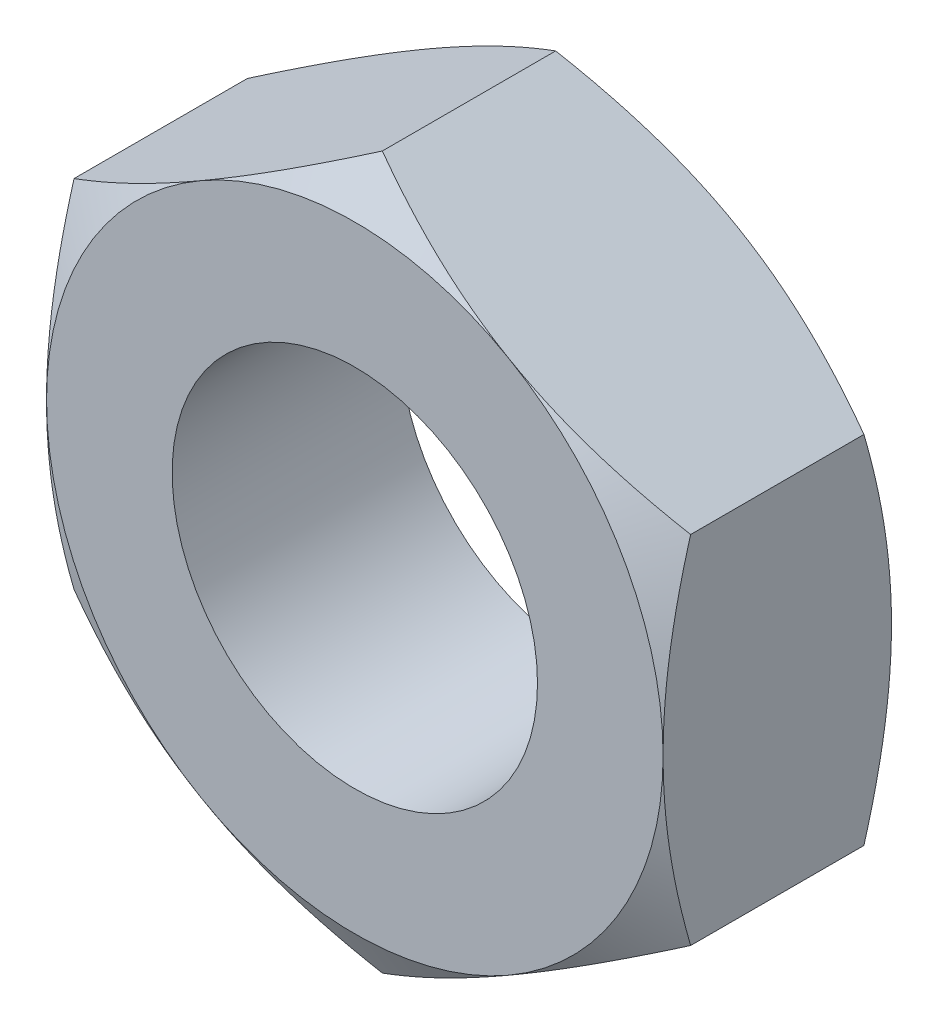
ISO-10303-21;
HEADER;
FILE_DESCRIPTION(('STEP AP214'),'2;1');
FILE_NAME('part.step','',(''),(''),'','','');
FILE_SCHEMA(('AUTOMOTIVE_DESIGN { 1 0 10303 214 1 1 1 1 }'));
ENDSEC;
DATA;
#1=APPLICATION_CONTEXT('core data for automotive mechanical design processes');
#2=APPLICATION_PROTOCOL_DEFINITION('international standard','automotive_design',2000,#1);
#3=PRODUCT_CONTEXT('',#1,'mechanical');
#4=PRODUCT('Part','Part','',(#3));
#5=PRODUCT_RELATED_PRODUCT_CATEGORY('part','',(#4));
#6=PRODUCT_DEFINITION_FORMATION('','',#4);
#7=PRODUCT_DEFINITION_CONTEXT('part definition',#1,'design');
#8=PRODUCT_DEFINITION('design','',#6,#7);
#9=PRODUCT_DEFINITION_SHAPE('','',#8);
#10=(LENGTH_UNIT() NAMED_UNIT(*) SI_UNIT(.MILLI.,.METRE.));
#11=(NAMED_UNIT(*) PLANE_ANGLE_UNIT() SI_UNIT($,.RADIAN.));
#12=(NAMED_UNIT(*) SI_UNIT($,.STERADIAN.) SOLID_ANGLE_UNIT());
#13=UNCERTAINTY_MEASURE_WITH_UNIT(LENGTH_MEASURE(1.E-05),#10,'distance_accuracy_value','');
#14=(GEOMETRIC_REPRESENTATION_CONTEXT(3) GLOBAL_UNCERTAINTY_ASSIGNED_CONTEXT((#13)) GLOBAL_UNIT_ASSIGNED_CONTEXT((#10,
#11,#12)) REPRESENTATION_CONTEXT('',''));
#15=CARTESIAN_POINT('',(0.,0.,0.));
#16=DIRECTION('',(0.,0.,1.));
#17=DIRECTION('',(1.,0.,0.));
#18=AXIS2_PLACEMENT_3D('',#15,#16,#17);
#19=CARTESIAN_POINT('',(13.5,7.79422863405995,10.));
#20=DIRECTION('',(-0.5,-0.866025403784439,0.));
#21=DIRECTION('',(0.866025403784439,-0.5,0.));
#22=AXIS2_PLACEMENT_3D('',#19,#20,#21);
#23=PLANE('',#22);
#24=CARTESIAN_POINT('',(-0.000199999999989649,15.5885727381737,1.20583803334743));
#25=CARTESIAN_POINT('',(0.296524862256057,15.417258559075,1.10693600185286));
#26=CARTESIAN_POINT('',(0.594407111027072,15.2452761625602,1.01252193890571));
#27=CARTESIAN_POINT('',(1.19256027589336,14.899932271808,0.833917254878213));
#28=CARTESIAN_POINT('',(1.49283194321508,14.7265703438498,0.749729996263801));
#29=CARTESIAN_POINT('',(2.09634426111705,14.3781323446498,0.592710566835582));
#30=CARTESIAN_POINT('',(2.39959019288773,14.2030532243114,0.519905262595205));
#31=CARTESIAN_POINT('',(3.00818925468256,13.8516783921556,0.387213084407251));
#32=CARTESIAN_POINT('',(3.31354226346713,13.6753827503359,0.327325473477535));
#33=CARTESIAN_POINT('',(3.91853115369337,13.3260922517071,0.223015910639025));
#34=CARTESIAN_POINT('',(4.21812211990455,13.1531233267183,0.178248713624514));
#35=CARTESIAN_POINT('',(4.81867684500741,12.8063928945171,0.103183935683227));
#36=CARTESIAN_POINT('',(5.11964063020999,12.632631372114,0.0728866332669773));
#37=CARTESIAN_POINT('',(5.72207378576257,12.284816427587,0.0275266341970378));
#38=CARTESIAN_POINT('',(6.02354212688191,12.1107635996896,0.0124458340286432));
#39=CARTESIAN_POINT('',(6.62675710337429,11.7624972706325,-0.00215683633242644));
#40=CARTESIAN_POINT('',(6.92850372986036,11.5882837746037,-0.00167918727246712));
#41=CARTESIAN_POINT('',(7.49261810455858,11.2625921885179,0.0137483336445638));
#42=CARTESIAN_POINT('',(7.75502605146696,11.1110908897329,0.0268164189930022));
#43=CARTESIAN_POINT('',(8.2792383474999,10.8084367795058,0.0644725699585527));
#44=CARTESIAN_POINT('',(8.54104265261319,10.6572839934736,0.0890614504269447));
#45=CARTESIAN_POINT('',(9.06390546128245,10.3554090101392,0.149330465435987));
#46=CARTESIAN_POINT('',(9.3249631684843,10.2046872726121,0.1850197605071));
#47=CARTESIAN_POINT('',(9.84585469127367,9.90395041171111,0.266863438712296));
#48=CARTESIAN_POINT('',(10.1056884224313,9.75393533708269,0.313018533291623));
#49=CARTESIAN_POINT('',(10.8944281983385,9.29855621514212,0.46834925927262));
#50=CARTESIAN_POINT('',(11.4210501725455,8.99451087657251,0.593013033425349));
#51=CARTESIAN_POINT('',(12.4664415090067,8.39095390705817,0.875948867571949));
#52=CARTESIAN_POINT('',(12.9852242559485,8.09143454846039,1.03415447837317));
#53=CARTESIAN_POINT('',(13.5002,7.79411316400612,1.20583803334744));
#54=B_SPLINE_CURVE_WITH_KNOTS('',3,(#24,#25,#26,#27,#28,#29,#30,#31,#32,#33,#34,#35,#36,#37,#38,
#39,#40,#41,#42,#43,#44,#45,#46,#47,#48,#49,#50,#51,#52,#53),.UNSPECIFIED.,.F.,.F.,(4,2,2,2,2,2,
2,2,2,2,2,2,2,2,4),(0.,1.06987949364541,2.14010980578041,3.21282939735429,4.28548777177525,
5.33167033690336,6.37787303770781,7.42282956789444,8.46775380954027,9.377387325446,
10.2870851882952,11.1975357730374,12.1080482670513,13.9691139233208,15.8265265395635),.UNSPECIFIED.);
#55=CARTESIAN_POINT('',(0.,15.5884572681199,1.20577136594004));
#56=VERTEX_POINT('',#55);
#57=CARTESIAN_POINT('',(6.75,11.6913429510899,0.));
#58=VERTEX_POINT('',#57);
#59=EDGE_CURVE('E29',#56,#58,#54,.T.);
#60=ORIENTED_EDGE('',*,*,#59,.F.);
#61=DIRECTION('',(0.,0.,-1.));
#62=VECTOR('',#61,1.);
#63=CARTESIAN_POINT('',(0.,15.5884572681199,10.));
#64=LINE('',#63,#62);
#65=CARTESIAN_POINT('',(0.,15.5884572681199,8.79422863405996));
#66=VERTEX_POINT('',#65);
#67=EDGE_CURVE('E146',#66,#56,#64,.T.);
#68=ORIENTED_EDGE('',*,*,#67,.F.);
#69=CARTESIAN_POINT('',(13.5002,7.79411316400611,8.79416196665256));
#70=CARTESIAN_POINT('',(13.2034751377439,7.9654273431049,8.89306399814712));
#71=CARTESIAN_POINT('',(12.9055928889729,8.13740973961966,8.98747806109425));
#72=CARTESIAN_POINT('',(12.3074397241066,8.48275363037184,9.16608274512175));
#73=CARTESIAN_POINT('',(12.0071680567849,8.65611555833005,9.25027000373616));
#74=CARTESIAN_POINT('',(11.403655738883,9.00455355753,9.40728943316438));
#75=CARTESIAN_POINT('',(11.1004098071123,9.17963267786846,9.48009473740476));
#76=CARTESIAN_POINT('',(10.4918107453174,9.53100751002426,9.61278691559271));
#77=CARTESIAN_POINT('',(10.1864577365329,9.7073031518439,9.67267452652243));
#78=CARTESIAN_POINT('',(9.58146884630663,10.0565936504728,9.77698408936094));
#79=CARTESIAN_POINT('',(9.28187788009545,10.2295625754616,9.82175128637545));
#80=CARTESIAN_POINT('',(8.68132315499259,10.5762930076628,9.89681606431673));
#81=CARTESIAN_POINT('',(8.38035936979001,10.7500545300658,9.92711336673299));
#82=CARTESIAN_POINT('',(7.77792621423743,11.0978694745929,9.97247336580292));
#83=CARTESIAN_POINT('',(7.47645787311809,11.2719223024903,9.98755416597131));
#84=CARTESIAN_POINT('',(6.87324289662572,11.6201886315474,10.0021568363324));
#85=CARTESIAN_POINT('',(6.57149627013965,11.7944021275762,10.0016791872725));
#86=CARTESIAN_POINT('',(6.00738189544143,12.1200937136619,9.98625166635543));
#87=CARTESIAN_POINT('',(5.74497394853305,12.271595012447,9.97318358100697));
#88=CARTESIAN_POINT('',(5.22076165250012,12.5742491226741,9.9355274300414));
#89=CARTESIAN_POINT('',(4.95895734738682,12.7254019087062,9.91093854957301));
#90=CARTESIAN_POINT('',(4.43609453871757,13.0272768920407,9.85066953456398));
#91=CARTESIAN_POINT('',(4.17503683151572,13.1779986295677,9.81498023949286));
#92=CARTESIAN_POINT('',(3.65414530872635,13.4787354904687,9.73313656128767));
#93=CARTESIAN_POINT('',(3.39431157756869,13.6287505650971,9.68698146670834));
#94=CARTESIAN_POINT('',(2.60557180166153,14.0841296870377,9.53165074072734));
#95=CARTESIAN_POINT('',(2.07894982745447,14.3881750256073,9.40698696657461));
#96=CARTESIAN_POINT('',(1.03355849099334,14.9917319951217,9.12405113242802));
#97=CARTESIAN_POINT('',(0.514775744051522,15.2912513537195,8.96584552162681));
#98=CARTESIAN_POINT('',(-0.000199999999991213,15.5885727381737,8.79416196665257));
#99=B_SPLINE_CURVE_WITH_KNOTS('',3,(#69,#70,#71,#72,#73,#74,#75,#76,#77,#78,#79,#80,#81,#82,#83,
#84,#85,#86,#87,#88,#89,#90,#91,#92,#93,#94,#95,#96,#97,#98),.UNSPECIFIED.,.F.,.F.,(4,2,2,2,2,2,
2,2,2,2,2,2,2,2,4),(0.,1.0698794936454,2.14010980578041,3.21282939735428,4.28548777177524,
5.33167033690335,6.3778730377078,7.42282956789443,8.46775380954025,9.37738732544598,
10.2870851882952,11.1975357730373,12.1080482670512,13.9691139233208,15.8265265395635),.UNSPECIFIED.);
#100=CARTESIAN_POINT('',(6.75,11.6913429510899,10.));
#101=VERTEX_POINT('',#100);
#102=EDGE_CURVE('E205',#101,#66,#99,.T.);
#103=ORIENTED_EDGE('',*,*,#102,.F.);
#104=CARTESIAN_POINT('',(13.5,7.79422863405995,8.79422863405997));
#105=VERTEX_POINT('',#104);
#106=EDGE_CURVE('E313',#105,#101,#99,.T.);
#107=ORIENTED_EDGE('',*,*,#106,.F.);
#108=DIRECTION('',(0.,0.,-1.));
#109=VECTOR('',#108,1.);
#110=CARTESIAN_POINT('',(13.5,7.79422863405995,10.));
#111=LINE('',#110,#109);
#112=CARTESIAN_POINT('',(13.5,7.79422863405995,1.20577136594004));
#113=VERTEX_POINT('',#112);
#114=EDGE_CURVE('E132',#105,#113,#111,.T.);
#115=ORIENTED_EDGE('',*,*,#114,.T.);
#116=EDGE_CURVE('E125',#58,#113,#54,.T.);
#117=ORIENTED_EDGE('',*,*,#116,.F.);
#118=EDGE_LOOP('',(#60,#68,#103,#107,#115,#117));
#119=FACE_BOUND('',#118,.T.);
#120=ADVANCED_FACE('F14',(#119),#23,.F.);
#121=CARTESIAN_POINT('',(0.,15.5884572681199,10.));
#122=DIRECTION('',(0.5,-0.866025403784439,0.));
#123=DIRECTION('',(0.866025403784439,0.5,0.));
#124=AXIS2_PLACEMENT_3D('',#121,#122,#123);
#125=PLANE('',#124);
#126=CARTESIAN_POINT('',(-13.5002,7.79411316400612,1.20583803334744));
#127=CARTESIAN_POINT('',(-13.2034751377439,7.9654273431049,1.10693600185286));
#128=CARTESIAN_POINT('',(-12.9055928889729,8.13740973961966,1.01252193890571));
#129=CARTESIAN_POINT('',(-12.3074397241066,8.48275363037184,0.833917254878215));
#130=CARTESIAN_POINT('',(-12.0071680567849,8.65611555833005,0.749729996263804));
#131=CARTESIAN_POINT('',(-11.403655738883,9.00455355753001,0.592710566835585));
#132=CARTESIAN_POINT('',(-11.1004098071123,9.17963267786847,0.519905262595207));
#133=CARTESIAN_POINT('',(-10.4918107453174,9.53100751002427,0.387213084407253));
#134=CARTESIAN_POINT('',(-10.1864577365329,9.7073031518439,0.32732547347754));
#135=CARTESIAN_POINT('',(-9.58146884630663,10.0565936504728,0.223015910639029));
#136=CARTESIAN_POINT('',(-9.28187788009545,10.2295625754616,0.178248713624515));
#137=CARTESIAN_POINT('',(-8.68132315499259,10.5762930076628,0.103183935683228));
#138=CARTESIAN_POINT('',(-8.38035936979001,10.7500545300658,0.0728866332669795));
#139=CARTESIAN_POINT('',(-7.77792621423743,11.0978694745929,0.0275266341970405));
#140=CARTESIAN_POINT('',(-7.47645787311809,11.2719223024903,0.0124458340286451));
#141=CARTESIAN_POINT('',(-6.87324289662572,11.6201886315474,-0.0021568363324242));
#142=CARTESIAN_POINT('',(-6.57149627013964,11.7944021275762,-0.00167918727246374));
#143=CARTESIAN_POINT('',(-6.00738189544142,12.1200937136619,0.0137483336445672));
#144=CARTESIAN_POINT('',(-5.74497394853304,12.271595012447,0.0268164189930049));
#145=CARTESIAN_POINT('',(-5.2207616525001,12.5742491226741,0.0644725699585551));
#146=CARTESIAN_POINT('',(-4.95895734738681,12.7254019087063,0.0890614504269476));
#147=CARTESIAN_POINT('',(-4.43609453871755,13.0272768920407,0.14933046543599));
#148=CARTESIAN_POINT('',(-4.1750368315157,13.1779986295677,0.185019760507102));
#149=CARTESIAN_POINT('',(-3.65414530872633,13.4787354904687,0.266863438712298));
#150=CARTESIAN_POINT('',(-3.39431157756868,13.6287505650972,0.313018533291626));
#151=CARTESIAN_POINT('',(-2.60557180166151,14.0841296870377,0.468349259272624));
#152=CARTESIAN_POINT('',(-2.07894982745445,14.3881750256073,0.593013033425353));
#153=CARTESIAN_POINT('',(-1.03355849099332,14.9917319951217,0.875948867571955));
#154=CARTESIAN_POINT('',(-0.514775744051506,15.2912513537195,1.03415447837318));
#155=CARTESIAN_POINT('',(0.000200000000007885,15.5885727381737,1.20583803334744));
#156=B_SPLINE_CURVE_WITH_KNOTS('',3,(#126,#127,#128,#129,#130,#131,#132,#133,#134,#135,#136,
#137,#138,#139,#140,#141,#142,#143,#144,#145,#146,#147,#148,#149,#150,#151,#152,#153,#154,#155),
.UNSPECIFIED.,.F.,.F.,(4,2,2,2,2,2,2,2,2,2,2,2,2,2,4),(0.,1.0698794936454,2.14010980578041,
3.21282939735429,4.28548777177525,5.33167033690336,6.37787303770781,7.42282956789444,
8.46775380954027,9.377387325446,10.2870851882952,11.1975357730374,12.1080482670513,
13.9691139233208,15.8265265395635),.UNSPECIFIED.);
#157=CARTESIAN_POINT('',(-13.5,7.79422863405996,1.20577136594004));
#158=VERTEX_POINT('',#157);
#159=CARTESIAN_POINT('',(-6.75,11.6913429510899,0.));
#160=VERTEX_POINT('',#159);
#161=EDGE_CURVE('E37',#158,#160,#156,.T.);
#162=ORIENTED_EDGE('',*,*,#161,.F.);
#163=DIRECTION('',(0.,0.,-1.));
#164=VECTOR('',#163,1.);
#165=CARTESIAN_POINT('',(-13.5,7.79422863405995,10.));
#166=LINE('',#165,#164);
#167=CARTESIAN_POINT('',(-13.5,7.79422863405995,8.79422863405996));
#168=VERTEX_POINT('',#167);
#169=EDGE_CURVE('E143',#168,#158,#166,.T.);
#170=ORIENTED_EDGE('',*,*,#169,.F.);
#171=CARTESIAN_POINT('',(0.000200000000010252,15.5885727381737,8.79416196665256));
#172=CARTESIAN_POINT('',(-0.296524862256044,15.417258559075,8.89306399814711));
#173=CARTESIAN_POINT('',(-0.594407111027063,15.2452761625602,8.98747806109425));
#174=CARTESIAN_POINT('',(-1.19256027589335,14.899932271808,9.16608274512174));
#175=CARTESIAN_POINT('',(-1.49283194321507,14.7265703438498,9.25027000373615));
#176=CARTESIAN_POINT('',(-2.09634426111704,14.3781323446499,9.40728943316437));
#177=CARTESIAN_POINT('',(-2.39959019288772,14.2030532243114,9.48009473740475));
#178=CARTESIAN_POINT('',(-3.00818925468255,13.8516783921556,9.61278691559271));
#179=CARTESIAN_POINT('',(-3.31354226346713,13.675382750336,9.67267452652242));
#180=CARTESIAN_POINT('',(-3.91853115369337,13.3260922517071,9.77698408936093));
#181=CARTESIAN_POINT('',(-4.21812211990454,13.1531233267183,9.82175128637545));
#182=CARTESIAN_POINT('',(-4.8186768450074,12.8063928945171,9.89681606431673));
#183=CARTESIAN_POINT('',(-5.11964063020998,12.632631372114,9.92711336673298));
#184=CARTESIAN_POINT('',(-5.72207378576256,12.284816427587,9.97247336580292));
#185=CARTESIAN_POINT('',(-6.0235421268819,12.1107635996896,9.98755416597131));
#186=CARTESIAN_POINT('',(-6.62675710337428,11.7624972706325,10.0021568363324));
#187=CARTESIAN_POINT('',(-6.92850372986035,11.5882837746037,10.0016791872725));
#188=CARTESIAN_POINT('',(-7.49261810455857,11.262592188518,9.98625166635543));
#189=CARTESIAN_POINT('',(-7.75502605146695,11.1110908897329,9.97318358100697));
#190=CARTESIAN_POINT('',(-8.27923834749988,10.8084367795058,9.9355274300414));
#191=CARTESIAN_POINT('',(-8.54104265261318,10.6572839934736,9.91093854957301));
#192=CARTESIAN_POINT('',(-9.06390546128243,10.3554090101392,9.85066953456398));
#193=CARTESIAN_POINT('',(-9.32496316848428,10.2046872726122,9.81498023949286));
#194=CARTESIAN_POINT('',(-9.84585469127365,9.90395041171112,9.73313656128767));
#195=CARTESIAN_POINT('',(-10.1056884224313,9.75393533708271,9.68698146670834));
#196=CARTESIAN_POINT('',(-10.8944281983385,9.29855621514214,9.53165074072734));
#197=CARTESIAN_POINT('',(-11.4210501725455,8.99451087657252,9.40698696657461));
#198=CARTESIAN_POINT('',(-12.4664415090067,8.39095390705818,9.12405113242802));
#199=CARTESIAN_POINT('',(-12.9852242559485,8.09143454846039,8.9658455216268));
#200=CARTESIAN_POINT('',(-13.5002,7.79411316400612,8.79416196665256));
#201=B_SPLINE_CURVE_WITH_KNOTS('',3,(#171,#172,#173,#174,#175,#176,#177,#178,#179,#180,#181,
#182,#183,#184,#185,#186,#187,#188,#189,#190,#191,#192,#193,#194,#195,#196,#197,#198,#199,#200),
.UNSPECIFIED.,.F.,.F.,(4,2,2,2,2,2,2,2,2,2,2,2,2,2,4),(0.,1.0698794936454,2.14010980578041,
3.21282939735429,4.28548777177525,5.33167033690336,6.37787303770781,7.42282956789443,
8.46775380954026,9.37738732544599,10.2870851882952,11.1975357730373,12.1080482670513,
13.9691139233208,15.8265265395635),.UNSPECIFIED.);
#202=CARTESIAN_POINT('',(-6.75,11.6913429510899,10.));
#203=VERTEX_POINT('',#202);
#204=EDGE_CURVE('E198',#203,#168,#201,.T.);
#205=ORIENTED_EDGE('',*,*,#204,.F.);
#206=EDGE_CURVE('E203',#66,#203,#201,.T.);
#207=ORIENTED_EDGE('',*,*,#206,.F.);
#208=ORIENTED_EDGE('',*,*,#67,.T.);
#209=EDGE_CURVE('E219',#160,#56,#156,.T.);
#210=ORIENTED_EDGE('',*,*,#209,.F.);
#211=EDGE_LOOP('',(#162,#170,#205,#207,#208,#210));
#212=FACE_BOUND('',#211,.T.);
#213=ADVANCED_FACE('F211',(#212),#125,.F.);
#214=CARTESIAN_POINT('',(-13.5,7.79422863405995,10.));
#215=DIRECTION('',(1.,0.,0.));
#216=DIRECTION('',(0.,1.,0.));
#217=AXIS2_PLACEMENT_3D('',#214,#215,#216);
#218=PLANE('',#217);
#219=CARTESIAN_POINT('',(-13.5,-20.8832877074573,6.56267104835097));
#220=CARTESIAN_POINT('',(-13.5,-20.5887076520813,6.41984362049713));
#221=CARTESIAN_POINT('',(-13.5,-20.2937804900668,6.27773243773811));
#222=CARTESIAN_POINT('',(-13.5,-19.7031594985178,5.99510488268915));
#223=CARTESIAN_POINT('',(-13.5,-19.4074656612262,5.85458852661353));
#224=CARTESIAN_POINT('',(-13.5,-18.5190459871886,5.43563780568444));
#225=CARTESIAN_POINT('',(-13.5,-17.9250699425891,5.15984455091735));
#226=CARTESIAN_POINT('',(-13.5,-16.7298672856,4.61548253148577));
#227=CARTESIAN_POINT('',(-13.5,-16.1286187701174,4.34696174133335));
#228=CARTESIAN_POINT('',(-13.5,-14.9213217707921,3.82097527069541));
#229=CARTESIAN_POINT('',(-13.5,-14.3152735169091,3.56350906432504));
#230=CARTESIAN_POINT('',(-13.5,-13.0780347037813,3.05458781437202));
#231=CARTESIAN_POINT('',(-13.5,-12.4466574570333,2.80358424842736));
#232=CARTESIAN_POINT('',(-13.5,-11.1764921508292,2.32070172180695));
#233=CARTESIAN_POINT('',(-13.5,-10.5377032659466,2.08882491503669));
#234=CARTESIAN_POINT('',(-13.5,-9.25293236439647,1.65032551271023));
#235=CARTESIAN_POINT('',(-13.5,-8.60696809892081,1.44365132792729));
#236=CARTESIAN_POINT('',(-13.5,-7.30571225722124,1.0622127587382));
#237=CARTESIAN_POINT('',(-13.5,-6.65042370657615,0.887438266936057));
#238=CARTESIAN_POINT('',(-13.5,-5.6622024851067,0.656030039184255));
#239=CARTESIAN_POINT('',(-13.5,-5.33281262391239,0.584172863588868));
#240=CARTESIAN_POINT('',(-13.5,-4.67179219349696,0.451570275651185));
#241=CARTESIAN_POINT('',(-13.5,-4.34016167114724,0.390824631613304));
#242=CARTESIAN_POINT('',(-13.5,-3.67489197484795,0.281520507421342));
#243=CARTESIAN_POINT('',(-13.5,-3.34125282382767,0.232961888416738));
#244=CARTESIAN_POINT('',(-13.5,-2.67232432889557,0.14900256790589));
#245=CARTESIAN_POINT('',(-13.5,-2.33703504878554,0.113601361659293));
#246=CARTESIAN_POINT('',(-13.5,-1.66962860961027,0.0571009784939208));
#247=CARTESIAN_POINT('',(-13.5,-1.33752675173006,0.0358221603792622));
#248=CARTESIAN_POINT('',(-13.5,-0.672721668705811,0.00732422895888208));
#249=CARTESIAN_POINT('',(-13.5,-0.340018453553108,0.000104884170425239));
#250=CARTESIAN_POINT('',(-13.5,0.32539608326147,-0.000102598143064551));
#251=CARTESIAN_POINT('',(-13.5,0.65810740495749,0.00690934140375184));
#252=CARTESIAN_POINT('',(-13.5,1.32294003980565,0.0349943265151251));
#253=CARTESIAN_POINT('',(-13.5,1.65506132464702,0.0560680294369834));
#254=CARTESIAN_POINT('',(-13.5,2.45487902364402,0.123305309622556));
#255=CARTESIAN_POINT('',(-13.5,2.92201684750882,0.176231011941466));
#256=CARTESIAN_POINT('',(-13.5,3.85279317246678,0.30700578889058));
#257=CARTESIAN_POINT('',(-13.5,4.31643118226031,0.384858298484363));
#258=CARTESIAN_POINT('',(-13.5,5.23977756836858,0.562717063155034));
#259=CARTESIAN_POINT('',(-13.5,5.69948254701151,0.6627407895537));
#260=CARTESIAN_POINT('',(-13.5,6.61426513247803,0.881892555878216));
#261=CARTESIAN_POINT('',(-13.5,7.06934281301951,1.00102029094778));
#262=CARTESIAN_POINT('',(-13.5,7.98481328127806,1.25828176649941));
#263=CARTESIAN_POINT('',(-13.5,8.44510454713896,1.39677428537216));
#264=CARTESIAN_POINT('',(-13.5,9.36115225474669,1.6879469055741));
#265=CARTESIAN_POINT('',(-13.5,9.8169086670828,1.84062709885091));
#266=CARTESIAN_POINT('',(-13.5,10.7241137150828,2.1577615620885));
#267=CARTESIAN_POINT('',(-13.5,11.1755637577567,2.32221182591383));
#268=CARTESIAN_POINT('',(-13.5,12.0747315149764,2.66096372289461));
#269=CARTESIAN_POINT('',(-13.5,12.5224492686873,2.83526525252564));
#270=CARTESIAN_POINT('',(-13.5,13.5599720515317,3.25023726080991));
#271=CARTESIAN_POINT('',(-13.5,14.1485286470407,3.49402397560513));
#272=CARTESIAN_POINT('',(-13.5,15.3207811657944,3.99304851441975));
#273=CARTESIAN_POINT('',(-13.5,15.9044768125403,4.24828698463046));
#274=CARTESIAN_POINT('',(-13.5,17.0678865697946,4.76797580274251));
#275=CARTESIAN_POINT('',(-13.5,17.6475998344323,5.03242803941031));
#276=CARTESIAN_POINT('',(-13.5,18.8035722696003,5.56873062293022));
#277=CARTESIAN_POINT('',(-13.5,19.3798315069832,5.84058082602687));
#278=CARTESIAN_POINT('',(-13.5,20.5300481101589,6.39061018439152));
#279=CARTESIAN_POINT('',(-13.5,21.104002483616,6.66879558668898));
#280=CARTESIAN_POINT('',(-13.5,22.2494623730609,7.23016206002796));
#281=CARTESIAN_POINT('',(-13.5,22.8209678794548,7.51334315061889));
#282=CARTESIAN_POINT('',(-13.5,23.9618303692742,8.08382774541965));
#283=CARTESIAN_POINT('',(-13.5,24.5311876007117,8.37113075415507));
#284=CARTESIAN_POINT('',(-13.5,25.6681262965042,8.94923103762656));
#285=CARTESIAN_POINT('',(-13.5,26.2357077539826,9.24002832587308));
#286=CARTESIAN_POINT('',(-13.5,27.8441624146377,10.0693943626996));
#287=CARTESIAN_POINT('',(-13.5,28.8832306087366,10.6114637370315));
#288=CARTESIAN_POINT('',(-13.5,30.9574721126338,11.7030678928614));
#289=CARTESIAN_POINT('',(-13.5,31.9926452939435,12.2526029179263));
#290=CARTESIAN_POINT('',(-13.5,34.0574712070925,13.3560994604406));
#291=CARTESIAN_POINT('',(-13.5,35.0871312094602,13.9100473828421));
#292=CARTESIAN_POINT('',(-13.5,36.6297739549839,14.7443167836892));
#293=CARTESIAN_POINT('',(-13.5,37.1436671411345,15.0229572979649));
#294=CARTESIAN_POINT('',(-13.5,38.1709062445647,15.5812434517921));
#295=CARTESIAN_POINT('',(-13.5,38.6842521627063,15.8608890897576));
#296=CARTESIAN_POINT('',(-13.5,39.1973550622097,16.1409800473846));
#297=B_SPLINE_CURVE_WITH_KNOTS('',3,(#219,#220,#221,#222,#223,#224,#225,#226,#227,#228,#229,
#230,#231,#232,#233,#234,#235,#236,#237,#238,#239,#240,#241,#242,#243,#244,#245,#246,#247,#248,
#249,#250,#251,#252,#253,#254,#255,#256,#257,#258,#259,#260,#261,#262,#263,#264,#265,#266,#267,
#268,#269,#270,#271,#272,#273,#274,#275,#276,#277,#278,#279,#280,#281,#282,#283,#284,#285,#286,
#287,#288,#289,#290,#291,#292,#293,#294,#295,#296),.UNSPECIFIED.,.F.,.F.,(4,2,2,2,2,2,2,2,2,2,2,
2,2,2,2,2,2,2,2,2,2,2,2,2,2,2,2,2,2,2,2,2,2,2,2,2,2,2,4),(0.,0.982135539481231,1.96428105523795,
3.9288654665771,5.90423537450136,7.8795112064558,9.91759750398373,11.9559130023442,
13.9899834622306,16.0234083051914,17.034661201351,18.0458930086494,19.0571132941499,
20.0682947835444,21.0663537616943,22.064396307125,23.0624442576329,24.0605388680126,
25.4701369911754,26.8799294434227,28.2908368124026,29.7017216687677,31.1434723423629,
32.5852323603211,34.0265039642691,35.4677604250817,37.3787436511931,39.2898348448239,
41.2013201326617,43.1127683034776,45.0261907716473,46.9396207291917,48.8528225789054,
50.7660318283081,54.2818810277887,57.7978452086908,61.3054677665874,63.0591888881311,
64.8129072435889),.UNSPECIFIED.);
#298=CARTESIAN_POINT('',(-13.5,-7.79422863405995,1.20577136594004));
#299=VERTEX_POINT('',#298);
#300=CARTESIAN_POINT('',(-13.5,0.,0.));
#301=VERTEX_POINT('',#300);
#302=EDGE_CURVE('E237',#299,#301,#297,.T.);
#303=ORIENTED_EDGE('',*,*,#302,.F.);
#304=DIRECTION('',(0.,0.,-1.));
#305=VECTOR('',#304,1.);
#306=CARTESIAN_POINT('',(-13.5,-7.79422863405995,10.));
#307=LINE('',#306,#305);
#308=CARTESIAN_POINT('',(-13.5,-7.79422863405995,8.79422863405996));
#309=VERTEX_POINT('',#308);
#310=EDGE_CURVE('E134',#309,#299,#307,.T.);
#311=ORIENTED_EDGE('',*,*,#310,.F.);
#312=CARTESIAN_POINT('',(-13.5,-20.8832877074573,3.43732895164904));
#313=CARTESIAN_POINT('',(-13.5,-20.5887076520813,3.58015637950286));
#314=CARTESIAN_POINT('',(-13.5,-20.2937804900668,3.72226756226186));
#315=CARTESIAN_POINT('',(-13.5,-19.7031594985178,4.00489511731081));
#316=CARTESIAN_POINT('',(-13.5,-19.4074656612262,4.14541147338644));
#317=CARTESIAN_POINT('',(-13.5,-18.5190459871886,4.56436219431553));
#318=CARTESIAN_POINT('',(-13.5,-17.9250699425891,4.84015544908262));
#319=CARTESIAN_POINT('',(-13.5,-16.7298672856,5.38451746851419));
#320=CARTESIAN_POINT('',(-13.5,-16.1286187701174,5.65303825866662));
#321=CARTESIAN_POINT('',(-13.5,-14.9213217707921,6.17902472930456));
#322=CARTESIAN_POINT('',(-13.5,-14.3152735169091,6.43649093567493));
#323=CARTESIAN_POINT('',(-13.5,-13.0780347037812,6.94541218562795));
#324=CARTESIAN_POINT('',(-13.5,-12.4466574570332,7.19641575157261));
#325=CARTESIAN_POINT('',(-13.5,-11.1764921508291,7.67929827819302));
#326=CARTESIAN_POINT('',(-13.5,-10.5377032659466,7.91117508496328));
#327=CARTESIAN_POINT('',(-13.5,-9.25293236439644,8.34967448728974));
#328=CARTESIAN_POINT('',(-13.5,-8.60696809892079,8.55634867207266));
#329=CARTESIAN_POINT('',(-13.5,-7.30571225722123,8.93778724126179));
#330=CARTESIAN_POINT('',(-13.5,-6.65042370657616,9.11256173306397));
#331=CARTESIAN_POINT('',(-13.5,-5.66220248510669,9.34396996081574));
#332=CARTESIAN_POINT('',(-13.5,-5.33281262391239,9.4158271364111));
#333=CARTESIAN_POINT('',(-13.5,-4.67179219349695,9.54842972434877));
#334=CARTESIAN_POINT('',(-13.5,-4.34016167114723,9.60917536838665));
#335=CARTESIAN_POINT('',(-13.5,-3.67489197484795,9.71847949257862));
#336=CARTESIAN_POINT('',(-13.5,-3.34125282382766,9.76703811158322));
#337=CARTESIAN_POINT('',(-13.5,-2.67232432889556,9.85099743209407));
#338=CARTESIAN_POINT('',(-13.5,-2.33703504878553,9.88639863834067));
#339=CARTESIAN_POINT('',(-13.5,-1.66962860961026,9.94289902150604));
#340=CARTESIAN_POINT('',(-13.5,-1.33752675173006,9.9641778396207));
#341=CARTESIAN_POINT('',(-13.5,-0.672721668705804,9.99267577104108));
#342=CARTESIAN_POINT('',(-13.5,-0.340018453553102,9.99989511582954));
#343=CARTESIAN_POINT('',(-13.5,0.325396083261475,10.000102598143));
#344=CARTESIAN_POINT('',(-13.5,0.658107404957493,9.9930906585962));
#345=CARTESIAN_POINT('',(-13.5,1.32294003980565,9.96500567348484));
#346=CARTESIAN_POINT('',(-13.5,1.65506132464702,9.94393197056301));
#347=CARTESIAN_POINT('',(-13.5,2.45487902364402,9.87669469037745));
#348=CARTESIAN_POINT('',(-13.5,2.92201684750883,9.82376898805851));
#349=CARTESIAN_POINT('',(-13.5,3.85279317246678,9.69299421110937));
#350=CARTESIAN_POINT('',(-13.5,4.31643118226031,9.6151417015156));
#351=CARTESIAN_POINT('',(-13.5,5.23977756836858,9.43728293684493));
#352=CARTESIAN_POINT('',(-13.5,5.69948254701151,9.33725921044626));
#353=CARTESIAN_POINT('',(-13.5,6.61426513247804,9.11810744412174));
#354=CARTESIAN_POINT('',(-13.5,7.06934281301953,8.99897970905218));
#355=CARTESIAN_POINT('',(-13.5,7.98481328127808,8.74171823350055));
#356=CARTESIAN_POINT('',(-13.5,8.44510454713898,8.6032257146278));
#357=CARTESIAN_POINT('',(-13.5,9.36115225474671,8.31205309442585));
#358=CARTESIAN_POINT('',(-13.5,9.81690866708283,8.15937290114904));
#359=CARTESIAN_POINT('',(-13.5,10.7241137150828,7.84223843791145));
#360=CARTESIAN_POINT('',(-13.5,11.1755637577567,7.67778817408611));
#361=CARTESIAN_POINT('',(-13.5,12.0747315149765,7.33903627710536));
#362=CARTESIAN_POINT('',(-13.5,12.5224492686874,7.16473474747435));
#363=CARTESIAN_POINT('',(-13.5,13.5599720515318,6.74976273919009));
#364=CARTESIAN_POINT('',(-13.5,14.1485286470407,6.50597602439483));
#365=CARTESIAN_POINT('',(-13.5,15.3207811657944,6.00695148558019));
#366=CARTESIAN_POINT('',(-13.5,15.9044768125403,5.75171301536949));
#367=CARTESIAN_POINT('',(-13.5,17.0678865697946,5.23202419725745));
#368=CARTESIAN_POINT('',(-13.5,17.6475998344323,4.96757196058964));
#369=CARTESIAN_POINT('',(-13.5,18.8035722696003,4.43126937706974));
#370=CARTESIAN_POINT('',(-13.5,19.3798315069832,4.15941917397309));
#371=CARTESIAN_POINT('',(-13.5,20.5300481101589,3.60938981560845));
#372=CARTESIAN_POINT('',(-13.5,21.104002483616,3.33120441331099));
#373=CARTESIAN_POINT('',(-13.5,22.2494623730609,2.76983793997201));
#374=CARTESIAN_POINT('',(-13.5,22.8209678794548,2.48665684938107));
#375=CARTESIAN_POINT('',(-13.5,23.9618303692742,1.91617225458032));
#376=CARTESIAN_POINT('',(-13.5,24.5311876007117,1.62886924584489));
#377=CARTESIAN_POINT('',(-13.5,25.6681262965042,1.05076896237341));
#378=CARTESIAN_POINT('',(-13.5,26.2357077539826,0.759971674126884));
#379=CARTESIAN_POINT('',(-13.5,27.8441624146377,-0.0693943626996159));
#380=CARTESIAN_POINT('',(-13.5,28.8832306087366,-0.611463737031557));
#381=CARTESIAN_POINT('',(-13.5,30.9574721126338,-1.70306789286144));
#382=CARTESIAN_POINT('',(-13.5,31.9926452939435,-2.25260291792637));
#383=CARTESIAN_POINT('',(-13.5,34.0574712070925,-3.35609946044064));
#384=CARTESIAN_POINT('',(-13.5,35.0871312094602,-3.91004738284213));
#385=CARTESIAN_POINT('',(-13.5,36.6297739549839,-4.7443167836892));
#386=CARTESIAN_POINT('',(-13.5,37.1436671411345,-5.02295729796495));
#387=CARTESIAN_POINT('',(-13.5,38.1709062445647,-5.58124345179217));
#388=CARTESIAN_POINT('',(-13.5,38.6842521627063,-5.8608890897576));
#389=CARTESIAN_POINT('',(-13.5,39.1973550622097,-6.14098004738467));
#390=B_SPLINE_CURVE_WITH_KNOTS('',3,(#312,#313,#314,#315,#316,#317,#318,#319,#320,#321,#322,
#323,#324,#325,#326,#327,#328,#329,#330,#331,#332,#333,#334,#335,#336,#337,#338,#339,#340,#341,
#342,#343,#344,#345,#346,#347,#348,#349,#350,#351,#352,#353,#354,#355,#356,#357,#358,#359,#360,
#361,#362,#363,#364,#365,#366,#367,#368,#369,#370,#371,#372,#373,#374,#375,#376,#377,#378,#379,
#380,#381,#382,#383,#384,#385,#386,#387,#388,#389),.UNSPECIFIED.,.F.,.F.,(4,2,2,2,2,2,2,2,2,2,2,
2,2,2,2,2,2,2,2,2,2,2,2,2,2,2,2,2,2,2,2,2,2,2,2,2,2,2,4),(0.,0.982135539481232,1.96428105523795,
3.9288654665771,5.90423537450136,7.87951120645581,9.91759750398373,11.9559130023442,
13.9899834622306,16.0234083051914,17.034661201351,18.0458930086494,19.0571132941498,
20.0682947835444,21.0663537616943,22.064396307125,23.0624442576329,24.0605388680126,
25.4701369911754,26.8799294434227,28.2908368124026,29.7017216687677,31.1434723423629,
32.5852323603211,34.0265039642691,35.4677604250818,37.3787436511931,39.289834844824,
41.2013201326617,43.1127683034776,45.0261907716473,46.9396207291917,48.8528225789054,
50.7660318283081,54.2818810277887,57.7978452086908,61.3054677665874,63.0591888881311,
64.8129072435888),.UNSPECIFIED.);
#391=CARTESIAN_POINT('',(-13.5,0.,10.));
#392=VERTEX_POINT('',#391);
#393=EDGE_CURVE('E191',#392,#309,#390,.F.);
#394=ORIENTED_EDGE('',*,*,#393,.F.);
#395=EDGE_CURVE('E204',#168,#392,#390,.F.);
#396=ORIENTED_EDGE('',*,*,#395,.F.);
#397=ORIENTED_EDGE('',*,*,#169,.T.);
#398=EDGE_CURVE('E232',#301,#158,#297,.T.);
#399=ORIENTED_EDGE('',*,*,#398,.F.);
#400=EDGE_LOOP('',(#303,#311,#394,#396,#397,#399));
#401=FACE_BOUND('',#400,.T.);
#402=ADVANCED_FACE('F214',(#401),#218,.F.);
#403=CARTESIAN_POINT('',(-13.5,-7.79422863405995,10.));
#404=DIRECTION('',(0.5,0.866025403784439,0.));
#405=DIRECTION('',(-0.866025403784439,0.5,0.));
#406=AXIS2_PLACEMENT_3D('',#403,#404,#405);
#407=PLANE('',#406);
#408=CARTESIAN_POINT('',(0.00019999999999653,-15.5885727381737,1.20583803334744));
#409=CARTESIAN_POINT('',(-0.296524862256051,-15.417258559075,1.10693600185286));
#410=CARTESIAN_POINT('',(-0.594407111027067,-15.2452761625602,1.01252193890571));
#411=CARTESIAN_POINT('',(-1.19256027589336,-14.899932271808,0.833917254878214));
#412=CARTESIAN_POINT('',(-1.49283194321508,-14.7265703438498,0.749729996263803));
#413=CARTESIAN_POINT('',(-2.09634426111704,-14.3781323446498,0.592710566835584));
#414=CARTESIAN_POINT('',(-2.39959019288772,-14.2030532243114,0.519905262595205));
#415=CARTESIAN_POINT('',(-3.00818925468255,-13.8516783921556,0.38721308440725));
#416=CARTESIAN_POINT('',(-3.31354226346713,-13.6753827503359,0.327325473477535));
#417=CARTESIAN_POINT('',(-3.91853115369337,-13.3260922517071,0.223015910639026));
#418=CARTESIAN_POINT('',(-4.21812211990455,-13.1531233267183,0.178248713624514));
#419=CARTESIAN_POINT('',(-4.81867684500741,-12.8063928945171,0.103183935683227));
#420=CARTESIAN_POINT('',(-5.11964063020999,-12.632631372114,0.0728866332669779));
#421=CARTESIAN_POINT('',(-5.72207378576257,-12.284816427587,0.0275266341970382));
#422=CARTESIAN_POINT('',(-6.02354212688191,-12.1107635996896,0.0124458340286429));
#423=CARTESIAN_POINT('',(-6.62675710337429,-11.7624972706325,-0.00215683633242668));
#424=CARTESIAN_POINT('',(-6.92850372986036,-11.5882837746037,-0.00167918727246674));
#425=CARTESIAN_POINT('',(-7.49261810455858,-11.2625921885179,0.0137483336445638));
#426=CARTESIAN_POINT('',(-7.75502605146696,-11.1110908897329,0.0268164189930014));
#427=CARTESIAN_POINT('',(-8.2792383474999,-10.8084367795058,0.0644725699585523));
#428=CARTESIAN_POINT('',(-8.54104265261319,-10.6572839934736,0.0890614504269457));
#429=CARTESIAN_POINT('',(-9.06390546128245,-10.3554090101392,0.149330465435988));
#430=CARTESIAN_POINT('',(-9.3249631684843,-10.2046872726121,0.1850197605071));
#431=CARTESIAN_POINT('',(-9.84585469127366,-9.90395041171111,0.266863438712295));
#432=CARTESIAN_POINT('',(-10.1056884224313,-9.75393533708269,0.313018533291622));
#433=CARTESIAN_POINT('',(-10.8944281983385,-9.29855621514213,0.468349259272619));
#434=CARTESIAN_POINT('',(-11.4210501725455,-8.99451087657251,0.593013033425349));
#435=CARTESIAN_POINT('',(-12.4664415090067,-8.39095390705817,0.875948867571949));
#436=CARTESIAN_POINT('',(-12.9852242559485,-8.09143454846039,1.03415447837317));
#437=CARTESIAN_POINT('',(-13.5002,-7.79411316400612,1.20583803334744));
#438=B_SPLINE_CURVE_WITH_KNOTS('',3,(#408,#409,#410,#411,#412,#413,#414,#415,#416,#417,#418,
#419,#420,#421,#422,#423,#424,#425,#426,#427,#428,#429,#430,#431,#432,#433,#434,#435,#436,#437),
.UNSPECIFIED.,.F.,.F.,(4,2,2,2,2,2,2,2,2,2,2,2,2,2,4),(0.,1.06987949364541,2.14010980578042,
3.21282939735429,4.28548777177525,5.33167033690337,6.37787303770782,7.42282956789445,
8.46775380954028,9.37738732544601,10.2870851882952,11.1975357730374,12.1080482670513,
13.9691139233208,15.8265265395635),.UNSPECIFIED.);
#439=CARTESIAN_POINT('',(0.,-15.5884572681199,1.20577136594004));
#440=VERTEX_POINT('',#439);
#441=CARTESIAN_POINT('',(-6.75,-11.6913429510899,0.));
#442=VERTEX_POINT('',#441);
#443=EDGE_CURVE('E226',#440,#442,#438,.T.);
#444=ORIENTED_EDGE('',*,*,#443,.F.);
#445=DIRECTION('',(0.,0.,-1.));
#446=VECTOR('',#445,1.);
#447=CARTESIAN_POINT('',(0.,-15.5884572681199,10.));
#448=LINE('',#447,#446);
#449=CARTESIAN_POINT('',(0.,-15.5884572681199,8.79422863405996));
#450=VERTEX_POINT('',#449);
#451=EDGE_CURVE('E131',#450,#440,#448,.T.);
#452=ORIENTED_EDGE('',*,*,#451,.F.);
#453=CARTESIAN_POINT('',(-13.5002,-7.79411316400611,8.79416196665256));
#454=CARTESIAN_POINT('',(-13.2034751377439,-7.9654273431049,8.89306399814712));
#455=CARTESIAN_POINT('',(-12.9055928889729,-8.13740973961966,8.98747806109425));
#456=CARTESIAN_POINT('',(-12.3074397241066,-8.48275363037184,9.16608274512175));
#457=CARTESIAN_POINT('',(-12.0071680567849,-8.65611555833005,9.25027000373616));
#458=CARTESIAN_POINT('',(-11.403655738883,-9.00455355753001,9.40728943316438));
#459=CARTESIAN_POINT('',(-11.1004098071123,-9.17963267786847,9.48009473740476));
#460=CARTESIAN_POINT('',(-10.4918107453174,-9.53100751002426,9.61278691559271));
#461=CARTESIAN_POINT('',(-10.1864577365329,-9.7073031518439,9.67267452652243));
#462=CARTESIAN_POINT('',(-9.58146884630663,-10.0565936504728,9.77698408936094));
#463=CARTESIAN_POINT('',(-9.28187788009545,-10.2295625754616,9.82175128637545));
#464=CARTESIAN_POINT('',(-8.68132315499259,-10.5762930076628,9.89681606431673));
#465=CARTESIAN_POINT('',(-8.38035936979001,-10.7500545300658,9.92711336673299));
#466=CARTESIAN_POINT('',(-7.77792621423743,-11.0978694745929,9.97247336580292));
#467=CARTESIAN_POINT('',(-7.47645787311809,-11.2719223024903,9.98755416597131));
#468=CARTESIAN_POINT('',(-6.87324289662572,-11.6201886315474,10.0021568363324));
#469=CARTESIAN_POINT('',(-6.57149627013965,-11.7944021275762,10.0016791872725));
#470=CARTESIAN_POINT('',(-6.00738189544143,-12.1200937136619,9.98625166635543));
#471=CARTESIAN_POINT('',(-5.74497394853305,-12.271595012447,9.97318358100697));
#472=CARTESIAN_POINT('',(-5.22076165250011,-12.5742491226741,9.9355274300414));
#473=CARTESIAN_POINT('',(-4.95895734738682,-12.7254019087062,9.91093854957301));
#474=CARTESIAN_POINT('',(-4.43609453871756,-13.0272768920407,9.85066953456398));
#475=CARTESIAN_POINT('',(-4.17503683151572,-13.1779986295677,9.81498023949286));
#476=CARTESIAN_POINT('',(-3.65414530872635,-13.4787354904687,9.73313656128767));
#477=CARTESIAN_POINT('',(-3.39431157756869,-13.6287505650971,9.68698146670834));
#478=CARTESIAN_POINT('',(-2.60557180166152,-14.0841296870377,9.53165074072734));
#479=CARTESIAN_POINT('',(-2.07894982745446,-14.3881750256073,9.40698696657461));
#480=CARTESIAN_POINT('',(-1.03355849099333,-14.9917319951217,9.12405113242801));
#481=CARTESIAN_POINT('',(-0.514775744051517,-15.2912513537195,8.9658455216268));
#482=CARTESIAN_POINT('',(0.000199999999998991,-15.5885727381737,8.79416196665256));
#483=B_SPLINE_CURVE_WITH_KNOTS('',3,(#453,#454,#455,#456,#457,#458,#459,#460,#461,#462,#463,
#464,#465,#466,#467,#468,#469,#470,#471,#472,#473,#474,#475,#476,#477,#478,#479,#480,#481,#482),
.UNSPECIFIED.,.F.,.F.,(4,2,2,2,2,2,2,2,2,2,2,2,2,2,4),(0.,1.0698794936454,2.14010980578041,
3.21282939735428,4.28548777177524,5.33167033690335,6.3778730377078,7.42282956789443,
8.46775380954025,9.37738732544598,10.2870851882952,11.1975357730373,12.1080482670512,
13.9691139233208,15.8265265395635),.UNSPECIFIED.);
#484=CARTESIAN_POINT('',(-6.75,-11.6913429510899,10.));
#485=VERTEX_POINT('',#484);
#486=EDGE_CURVE('E184',#485,#450,#483,.T.);
#487=ORIENTED_EDGE('',*,*,#486,.F.);
#488=EDGE_CURVE('E484',#309,#485,#483,.T.);
#489=ORIENTED_EDGE('',*,*,#488,.F.);
#490=ORIENTED_EDGE('',*,*,#310,.T.);
#491=EDGE_CURVE('E238',#442,#299,#438,.T.);
#492=ORIENTED_EDGE('',*,*,#491,.F.);
#493=EDGE_LOOP('',(#444,#452,#487,#489,#490,#492));
#494=FACE_BOUND('',#493,.T.);
#495=ADVANCED_FACE('F292',(#494),#407,.F.);
#496=CARTESIAN_POINT('',(0.,-15.5884572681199,10.));
#497=DIRECTION('',(-0.5,0.866025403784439,0.));
#498=DIRECTION('',(-0.866025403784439,-0.5,0.));
#499=AXIS2_PLACEMENT_3D('',#496,#497,#498);
#500=PLANE('',#499);
#501=CARTESIAN_POINT('',(13.5002,-7.79411316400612,1.20583803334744));
#502=CARTESIAN_POINT('',(13.2034751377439,-7.9654273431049,1.10693600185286));
#503=CARTESIAN_POINT('',(12.9055928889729,-8.13740973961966,1.01252193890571));
#504=CARTESIAN_POINT('',(12.3074397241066,-8.48275363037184,0.833917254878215));
#505=CARTESIAN_POINT('',(12.0071680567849,-8.65611555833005,0.749729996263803));
#506=CARTESIAN_POINT('',(11.403655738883,-9.00455355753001,0.592710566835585));
#507=CARTESIAN_POINT('',(11.1004098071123,-9.17963267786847,0.519905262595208));
#508=CARTESIAN_POINT('',(10.4918107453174,-9.53100751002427,0.387213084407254));
#509=CARTESIAN_POINT('',(10.1864577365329,-9.7073031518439,0.327325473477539));
#510=CARTESIAN_POINT('',(9.58146884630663,-10.0565936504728,0.223015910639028));
#511=CARTESIAN_POINT('',(9.28187788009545,-10.2295625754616,0.178248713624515));
#512=CARTESIAN_POINT('',(8.68132315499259,-10.5762930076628,0.103183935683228));
#513=CARTESIAN_POINT('',(8.38035936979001,-10.7500545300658,0.0728866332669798));
#514=CARTESIAN_POINT('',(7.77792621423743,-11.0978694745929,0.0275266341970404));
#515=CARTESIAN_POINT('',(7.47645787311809,-11.2719223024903,0.0124458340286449));
#516=CARTESIAN_POINT('',(6.87324289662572,-11.6201886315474,-0.00215683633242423));
#517=CARTESIAN_POINT('',(6.57149627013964,-11.7944021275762,-0.0016791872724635));
#518=CARTESIAN_POINT('',(6.00738189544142,-12.1200937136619,0.0137483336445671));
#519=CARTESIAN_POINT('',(5.74497394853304,-12.271595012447,0.0268164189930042));
#520=CARTESIAN_POINT('',(5.2207616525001,-12.5742491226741,0.0644725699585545));
#521=CARTESIAN_POINT('',(4.95895734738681,-12.7254019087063,0.0890614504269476));
#522=CARTESIAN_POINT('',(4.43609453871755,-13.0272768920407,0.14933046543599));
#523=CARTESIAN_POINT('',(4.1750368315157,-13.1779986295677,0.185019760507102));
#524=CARTESIAN_POINT('',(3.65414530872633,-13.4787354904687,0.266863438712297));
#525=CARTESIAN_POINT('',(3.39431157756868,-13.6287505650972,0.313018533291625));
#526=CARTESIAN_POINT('',(2.60557180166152,-14.0841296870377,0.468349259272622));
#527=CARTESIAN_POINT('',(2.07894982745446,-14.3881750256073,0.593013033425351));
#528=CARTESIAN_POINT('',(1.03355849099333,-14.9917319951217,0.875948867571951));
#529=CARTESIAN_POINT('',(0.514775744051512,-15.2912513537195,1.03415447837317));
#530=CARTESIAN_POINT('',(-0.000200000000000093,-15.5885727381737,1.20583803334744));
#531=B_SPLINE_CURVE_WITH_KNOTS('',3,(#501,#502,#503,#504,#505,#506,#507,#508,#509,#510,#511,
#512,#513,#514,#515,#516,#517,#518,#519,#520,#521,#522,#523,#524,#525,#526,#527,#528,#529,#530),
.UNSPECIFIED.,.F.,.F.,(4,2,2,2,2,2,2,2,2,2,2,2,2,2,4),(0.,1.06987949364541,2.14010980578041,
3.21282939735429,4.28548777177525,5.33167033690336,6.37787303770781,7.42282956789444,
8.46775380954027,9.377387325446,10.2870851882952,11.1975357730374,12.1080482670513,
13.9691139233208,15.8265265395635),.UNSPECIFIED.);
#532=CARTESIAN_POINT('',(13.5,-7.79422863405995,1.20577136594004));
#533=VERTEX_POINT('',#532);
#534=CARTESIAN_POINT('',(6.75,-11.6913429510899,0.));
#535=VERTEX_POINT('',#534);
#536=EDGE_CURVE('E108',#533,#535,#531,.T.);
#537=ORIENTED_EDGE('',*,*,#536,.F.);
#538=DIRECTION('',(0.,0.,-1.));
#539=VECTOR('',#538,1.);
#540=CARTESIAN_POINT('',(13.5,-7.79422863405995,10.));
#541=LINE('',#540,#539);
#542=CARTESIAN_POINT('',(13.5,-7.79422863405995,8.79422863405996));
#543=VERTEX_POINT('',#542);
#544=EDGE_CURVE('E122',#543,#533,#541,.T.);
#545=ORIENTED_EDGE('',*,*,#544,.F.);
#546=CARTESIAN_POINT('',(-0.000200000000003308,-15.5885727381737,8.79416196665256));
#547=CARTESIAN_POINT('',(0.29652486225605,-15.417258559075,8.89306399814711));
#548=CARTESIAN_POINT('',(0.594407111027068,-15.2452761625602,8.98747806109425));
#549=CARTESIAN_POINT('',(1.19256027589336,-14.899932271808,9.16608274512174));
#550=CARTESIAN_POINT('',(1.49283194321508,-14.7265703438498,9.25027000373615));
#551=CARTESIAN_POINT('',(2.09634426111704,-14.3781323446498,9.40728943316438));
#552=CARTESIAN_POINT('',(2.39959019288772,-14.2030532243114,9.48009473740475));
#553=CARTESIAN_POINT('',(3.00818925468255,-13.8516783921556,9.61278691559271));
#554=CARTESIAN_POINT('',(3.31354226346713,-13.675382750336,9.67267452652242));
#555=CARTESIAN_POINT('',(3.91853115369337,-13.3260922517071,9.77698408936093));
#556=CARTESIAN_POINT('',(4.21812211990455,-13.1531233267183,9.82175128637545));
#557=CARTESIAN_POINT('',(4.8186768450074,-12.8063928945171,9.89681606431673));
#558=CARTESIAN_POINT('',(5.11964063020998,-12.632631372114,9.92711336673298));
#559=CARTESIAN_POINT('',(5.72207378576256,-12.284816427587,9.97247336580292));
#560=CARTESIAN_POINT('',(6.0235421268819,-12.1107635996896,9.98755416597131));
#561=CARTESIAN_POINT('',(6.62675710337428,-11.7624972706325,10.0021568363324));
#562=CARTESIAN_POINT('',(6.92850372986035,-11.5882837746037,10.0016791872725));
#563=CARTESIAN_POINT('',(7.49261810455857,-11.262592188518,9.98625166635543));
#564=CARTESIAN_POINT('',(7.75502605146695,-11.1110908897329,9.97318358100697));
#565=CARTESIAN_POINT('',(8.27923834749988,-10.8084367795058,9.9355274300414));
#566=CARTESIAN_POINT('',(8.54104265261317,-10.6572839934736,9.91093854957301));
#567=CARTESIAN_POINT('',(9.06390546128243,-10.3554090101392,9.85066953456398));
#568=CARTESIAN_POINT('',(9.32496316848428,-10.2046872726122,9.81498023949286));
#569=CARTESIAN_POINT('',(9.84585469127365,-9.90395041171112,9.73313656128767));
#570=CARTESIAN_POINT('',(10.1056884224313,-9.7539353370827,9.68698146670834));
#571=CARTESIAN_POINT('',(10.8944281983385,-9.29855621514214,9.53165074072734));
#572=CARTESIAN_POINT('',(11.4210501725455,-8.99451087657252,9.40698696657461));
#573=CARTESIAN_POINT('',(12.4664415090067,-8.39095390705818,9.12405113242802));
#574=CARTESIAN_POINT('',(12.9852242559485,-8.09143454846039,8.9658455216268));
#575=CARTESIAN_POINT('',(13.5002,-7.79411316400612,8.79416196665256));
#576=B_SPLINE_CURVE_WITH_KNOTS('',3,(#546,#547,#548,#549,#550,#551,#552,#553,#554,#555,#556,
#557,#558,#559,#560,#561,#562,#563,#564,#565,#566,#567,#568,#569,#570,#571,#572,#573,#574,#575),
.UNSPECIFIED.,.F.,.F.,(4,2,2,2,2,2,2,2,2,2,2,2,2,2,4),(0.,1.0698794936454,2.14010980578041,
3.21282939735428,4.28548777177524,5.33167033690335,6.3778730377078,7.42282956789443,
8.46775380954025,9.37738732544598,10.2870851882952,11.1975357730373,12.1080482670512,
13.9691139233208,15.8265265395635),.UNSPECIFIED.);
#577=CARTESIAN_POINT('',(6.75,-11.6913429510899,10.));
#578=VERTEX_POINT('',#577);
#579=EDGE_CURVE('E176',#578,#543,#576,.T.);
#580=ORIENTED_EDGE('',*,*,#579,.F.);
#581=EDGE_CURVE('E247',#450,#578,#576,.T.);
#582=ORIENTED_EDGE('',*,*,#581,.F.);
#583=ORIENTED_EDGE('',*,*,#451,.T.);
#584=EDGE_CURVE('E124',#535,#440,#531,.T.);
#585=ORIENTED_EDGE('',*,*,#584,.F.);
#586=EDGE_LOOP('',(#537,#545,#580,#582,#583,#585));
#587=FACE_BOUND('',#586,.T.);
#588=ADVANCED_FACE('F120',(#587),#500,.F.);
#589=CARTESIAN_POINT('',(13.5,-7.79422863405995,10.));
#590=DIRECTION('',(-1.,0.,0.));
#591=DIRECTION('',(0.,-1.,0.));
#592=AXIS2_PLACEMENT_3D('',#589,#590,#591);
#593=PLANE('',#592);
#594=CARTESIAN_POINT('',(13.5,-20.8832877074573,6.56267104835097));
#595=CARTESIAN_POINT('',(13.5,-20.5887076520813,6.41984362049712));
#596=CARTESIAN_POINT('',(13.5,-20.2937804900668,6.27773243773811));
#597=CARTESIAN_POINT('',(13.5,-19.7031594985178,5.99510488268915));
#598=CARTESIAN_POINT('',(13.5,-19.4074656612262,5.85458852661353));
#599=CARTESIAN_POINT('',(13.5,-18.5190459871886,5.43563780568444));
#600=CARTESIAN_POINT('',(13.5,-17.9250699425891,5.15984455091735));
#601=CARTESIAN_POINT('',(13.5,-16.7298672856,4.61548253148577));
#602=CARTESIAN_POINT('',(13.5,-16.1286187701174,4.34696174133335));
#603=CARTESIAN_POINT('',(13.5,-14.9213217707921,3.82097527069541));
#604=CARTESIAN_POINT('',(13.5,-14.3152735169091,3.56350906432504));
#605=CARTESIAN_POINT('',(13.5,-13.0780347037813,3.05458781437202));
#606=CARTESIAN_POINT('',(13.5,-12.4466574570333,2.80358424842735));
#607=CARTESIAN_POINT('',(13.5,-11.1764921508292,2.32070172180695));
#608=CARTESIAN_POINT('',(13.5,-10.5377032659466,2.08882491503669));
#609=CARTESIAN_POINT('',(13.5,-9.25293236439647,1.65032551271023));
#610=CARTESIAN_POINT('',(13.5,-8.60696809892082,1.44365132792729));
#611=CARTESIAN_POINT('',(13.5,-7.30571225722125,1.0622127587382));
#612=CARTESIAN_POINT('',(13.5,-6.65042370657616,0.887438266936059));
#613=CARTESIAN_POINT('',(13.5,-5.66220248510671,0.656030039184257));
#614=CARTESIAN_POINT('',(13.5,-5.3328126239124,0.58417286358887));
#615=CARTESIAN_POINT('',(13.5,-4.67179219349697,0.451570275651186));
#616=CARTESIAN_POINT('',(13.5,-4.34016167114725,0.390824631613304));
#617=CARTESIAN_POINT('',(13.5,-3.67489197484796,0.281520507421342));
#618=CARTESIAN_POINT('',(13.5,-3.34125282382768,0.232961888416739));
#619=CARTESIAN_POINT('',(13.5,-2.67232432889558,0.149002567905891));
#620=CARTESIAN_POINT('',(13.5,-2.33703504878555,0.113601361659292));
#621=CARTESIAN_POINT('',(13.5,-1.66962860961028,0.0571009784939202));
#622=CARTESIAN_POINT('',(13.5,-1.33752675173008,0.0358221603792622));
#623=CARTESIAN_POINT('',(13.5,-0.672721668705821,0.00732422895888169));
#624=CARTESIAN_POINT('',(13.5,-0.340018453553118,0.000104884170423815));
#625=CARTESIAN_POINT('',(13.5,0.32539608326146,-0.00010259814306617));
#626=CARTESIAN_POINT('',(13.5,0.65810740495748,0.00690934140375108));
#627=CARTESIAN_POINT('',(13.5,1.32294003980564,0.0349943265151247));
#628=CARTESIAN_POINT('',(13.5,1.65506132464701,0.0560680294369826));
#629=CARTESIAN_POINT('',(13.5,2.45487902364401,0.123305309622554));
#630=CARTESIAN_POINT('',(13.5,2.92201684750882,0.176231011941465));
#631=CARTESIAN_POINT('',(13.5,3.85279317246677,0.307005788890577));
#632=CARTESIAN_POINT('',(13.5,4.3164311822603,0.384858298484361));
#633=CARTESIAN_POINT('',(13.5,5.23977756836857,0.562717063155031));
#634=CARTESIAN_POINT('',(13.5,5.6994825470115,0.662740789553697));
#635=CARTESIAN_POINT('',(13.5,6.61426513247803,0.881892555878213));
#636=CARTESIAN_POINT('',(13.5,7.06934281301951,1.00102029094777));
#637=CARTESIAN_POINT('',(13.5,7.98481328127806,1.25828176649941));
#638=CARTESIAN_POINT('',(13.5,8.44510454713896,1.39677428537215));
#639=CARTESIAN_POINT('',(13.5,9.36115225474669,1.6879469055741));
#640=CARTESIAN_POINT('',(13.5,9.8169086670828,1.84062709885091));
#641=CARTESIAN_POINT('',(13.5,10.7241137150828,2.1577615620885));
#642=CARTESIAN_POINT('',(13.5,11.1755637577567,2.32221182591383));
#643=CARTESIAN_POINT('',(13.5,12.0747315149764,2.6609637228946));
#644=CARTESIAN_POINT('',(13.5,12.5224492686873,2.83526525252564));
#645=CARTESIAN_POINT('',(13.5,13.5599720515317,3.25023726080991));
#646=CARTESIAN_POINT('',(13.5,14.1485286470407,3.49402397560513));
#647=CARTESIAN_POINT('',(13.5,15.3207811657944,3.99304851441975));
#648=CARTESIAN_POINT('',(13.5,15.9044768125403,4.24828698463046));
#649=CARTESIAN_POINT('',(13.5,17.0678865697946,4.76797580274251));
#650=CARTESIAN_POINT('',(13.5,17.6475998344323,5.03242803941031));
#651=CARTESIAN_POINT('',(13.5,18.8035722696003,5.56873062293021));
#652=CARTESIAN_POINT('',(13.5,19.3798315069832,5.84058082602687));
#653=CARTESIAN_POINT('',(13.5,20.5300481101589,6.39061018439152));
#654=CARTESIAN_POINT('',(13.5,21.104002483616,6.66879558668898));
#655=CARTESIAN_POINT('',(13.5,22.2494623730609,7.23016206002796));
#656=CARTESIAN_POINT('',(13.5,22.8209678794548,7.51334315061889));
#657=CARTESIAN_POINT('',(13.5,23.9618303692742,8.08382774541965));
#658=CARTESIAN_POINT('',(13.5,24.5311876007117,8.37113075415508));
#659=CARTESIAN_POINT('',(13.5,25.6681262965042,8.94923103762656));
#660=CARTESIAN_POINT('',(13.5,26.2357077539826,9.24002832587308));
#661=CARTESIAN_POINT('',(13.5,27.8441624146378,10.0693943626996));
#662=CARTESIAN_POINT('',(13.5,28.8832306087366,10.6114637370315));
#663=CARTESIAN_POINT('',(13.5,30.9574721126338,11.7030678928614));
#664=CARTESIAN_POINT('',(13.5,31.9926452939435,12.2526029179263));
#665=CARTESIAN_POINT('',(13.5,34.0574712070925,13.3560994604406));
#666=CARTESIAN_POINT('',(13.5,35.0871312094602,13.9100473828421));
#667=CARTESIAN_POINT('',(13.5,36.6297739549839,14.7443167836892));
#668=CARTESIAN_POINT('',(13.5,37.1436671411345,15.0229572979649));
#669=CARTESIAN_POINT('',(13.5,38.1709062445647,15.5812434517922));
#670=CARTESIAN_POINT('',(13.5,38.6842521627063,15.8608890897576));
#671=CARTESIAN_POINT('',(13.5,39.1973550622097,16.1409800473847));
#672=B_SPLINE_CURVE_WITH_KNOTS('',3,(#594,#595,#596,#597,#598,#599,#600,#601,#602,#603,#604,
#605,#606,#607,#608,#609,#610,#611,#612,#613,#614,#615,#616,#617,#618,#619,#620,#621,#622,#623,
#624,#625,#626,#627,#628,#629,#630,#631,#632,#633,#634,#635,#636,#637,#638,#639,#640,#641,#642,
#643,#644,#645,#646,#647,#648,#649,#650,#651,#652,#653,#654,#655,#656,#657,#658,#659,#660,#661,
#662,#663,#664,#665,#666,#667,#668,#669,#670,#671),.UNSPECIFIED.,.F.,.F.,(4,2,2,2,2,2,2,2,2,2,2,
2,2,2,2,2,2,2,2,2,2,2,2,2,2,2,2,2,2,2,2,2,2,2,2,2,2,2,4),(0.,0.982135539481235,1.96428105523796,
3.92886546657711,5.90423537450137,7.8795112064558,9.91759750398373,11.9559130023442,
13.9899834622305,16.0234083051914,17.034661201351,18.0458930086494,19.0571132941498,
20.0682947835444,21.0663537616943,22.064396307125,23.0624442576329,24.0605388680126,
25.4701369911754,26.8799294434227,28.2908368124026,29.7017216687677,31.1434723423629,
32.5852323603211,34.0265039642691,35.4677604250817,37.3787436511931,39.2898348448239,
41.2013201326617,43.1127683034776,45.0261907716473,46.9396207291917,48.8528225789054,
50.7660318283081,54.2818810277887,57.7978452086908,61.3054677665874,63.0591888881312,
64.8129072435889),.UNSPECIFIED.);
#673=CARTESIAN_POINT('',(13.5,0.,0.));
#674=VERTEX_POINT('',#673);
#675=EDGE_CURVE('E114',#113,#674,#672,.F.);
#676=ORIENTED_EDGE('',*,*,#675,.F.);
#677=ORIENTED_EDGE('',*,*,#114,.F.);
#678=CARTESIAN_POINT('',(13.5,-20.8832877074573,3.43732895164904));
#679=CARTESIAN_POINT('',(13.5,-20.5887076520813,3.58015637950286));
#680=CARTESIAN_POINT('',(13.5,-20.2937804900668,3.72226756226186));
#681=CARTESIAN_POINT('',(13.5,-19.7031594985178,4.00489511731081));
#682=CARTESIAN_POINT('',(13.5,-19.4074656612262,4.14541147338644));
#683=CARTESIAN_POINT('',(13.5,-18.5190459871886,4.56436219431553));
#684=CARTESIAN_POINT('',(13.5,-17.9250699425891,4.84015544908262));
#685=CARTESIAN_POINT('',(13.5,-16.7298672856,5.38451746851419));
#686=CARTESIAN_POINT('',(13.5,-16.1286187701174,5.65303825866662));
#687=CARTESIAN_POINT('',(13.5,-14.9213217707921,6.17902472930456));
#688=CARTESIAN_POINT('',(13.5,-14.3152735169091,6.43649093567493));
#689=CARTESIAN_POINT('',(13.5,-13.0780347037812,6.94541218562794));
#690=CARTESIAN_POINT('',(13.5,-12.4466574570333,7.19641575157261));
#691=CARTESIAN_POINT('',(13.5,-11.1764921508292,7.67929827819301));
#692=CARTESIAN_POINT('',(13.5,-10.5377032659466,7.91117508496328));
#693=CARTESIAN_POINT('',(13.5,-9.25293236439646,8.34967448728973));
#694=CARTESIAN_POINT('',(13.5,-8.60696809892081,8.55634867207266));
#695=CARTESIAN_POINT('',(13.5,-7.30571225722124,8.93778724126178));
#696=CARTESIAN_POINT('',(13.5,-6.65042370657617,9.11256173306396));
#697=CARTESIAN_POINT('',(13.5,-5.6622024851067,9.34396996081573));
#698=CARTESIAN_POINT('',(13.5,-5.3328126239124,9.4158271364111));
#699=CARTESIAN_POINT('',(13.5,-4.67179219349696,9.54842972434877));
#700=CARTESIAN_POINT('',(13.5,-4.34016167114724,9.60917536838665));
#701=CARTESIAN_POINT('',(13.5,-3.67489197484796,9.71847949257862));
#702=CARTESIAN_POINT('',(13.5,-3.34125282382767,9.76703811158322));
#703=CARTESIAN_POINT('',(13.5,-2.67232432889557,9.85099743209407));
#704=CARTESIAN_POINT('',(13.5,-2.33703504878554,9.88639863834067));
#705=CARTESIAN_POINT('',(13.5,-1.66962860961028,9.94289902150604));
#706=CARTESIAN_POINT('',(13.5,-1.33752675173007,9.9641778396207));
#707=CARTESIAN_POINT('',(13.5,-0.672721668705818,9.99267577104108));
#708=CARTESIAN_POINT('',(13.5,-0.340018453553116,9.99989511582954));
#709=CARTESIAN_POINT('',(13.5,0.32539608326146,10.000102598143));
#710=CARTESIAN_POINT('',(13.5,0.658107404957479,9.9930906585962));
#711=CARTESIAN_POINT('',(13.5,1.32294003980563,9.96500567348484));
#712=CARTESIAN_POINT('',(13.5,1.65506132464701,9.94393197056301));
#713=CARTESIAN_POINT('',(13.5,2.45487902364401,9.87669469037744));
#714=CARTESIAN_POINT('',(13.5,2.92201684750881,9.82376898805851));
#715=CARTESIAN_POINT('',(13.5,3.85279317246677,9.69299421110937));
#716=CARTESIAN_POINT('',(13.5,4.31643118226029,9.6151417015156));
#717=CARTESIAN_POINT('',(13.5,5.23977756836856,9.43728293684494));
#718=CARTESIAN_POINT('',(13.5,5.69948254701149,9.33725921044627));
#719=CARTESIAN_POINT('',(13.5,6.61426513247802,9.11810744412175));
#720=CARTESIAN_POINT('',(13.5,7.0693428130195,8.99897970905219));
#721=CARTESIAN_POINT('',(13.5,7.98481328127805,8.74171823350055));
#722=CARTESIAN_POINT('',(13.5,8.44510454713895,8.60322571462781));
#723=CARTESIAN_POINT('',(13.5,9.36115225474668,8.31205309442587));
#724=CARTESIAN_POINT('',(13.5,9.81690866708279,8.15937290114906));
#725=CARTESIAN_POINT('',(13.5,10.7241137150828,7.84223843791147));
#726=CARTESIAN_POINT('',(13.5,11.1755637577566,7.67778817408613));
#727=CARTESIAN_POINT('',(13.5,12.0747315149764,7.33903627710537));
#728=CARTESIAN_POINT('',(13.5,12.5224492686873,7.16473474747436));
#729=CARTESIAN_POINT('',(13.5,13.5599720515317,6.7497627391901));
#730=CARTESIAN_POINT('',(13.5,14.1485286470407,6.50597602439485));
#731=CARTESIAN_POINT('',(13.5,15.3207811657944,6.00695148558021));
#732=CARTESIAN_POINT('',(13.5,15.9044768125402,5.75171301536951));
#733=CARTESIAN_POINT('',(13.5,17.0678865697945,5.23202419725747));
#734=CARTESIAN_POINT('',(13.5,17.6475998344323,4.96757196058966));
#735=CARTESIAN_POINT('',(13.5,18.8035722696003,4.43126937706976));
#736=CARTESIAN_POINT('',(13.5,19.3798315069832,4.15941917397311));
#737=CARTESIAN_POINT('',(13.5,20.5300481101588,3.60938981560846));
#738=CARTESIAN_POINT('',(13.5,21.104002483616,3.331204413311));
#739=CARTESIAN_POINT('',(13.5,22.2494623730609,2.76983793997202));
#740=CARTESIAN_POINT('',(13.5,22.8209678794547,2.48665684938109));
#741=CARTESIAN_POINT('',(13.5,23.9618303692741,1.91617225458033));
#742=CARTESIAN_POINT('',(13.5,24.5311876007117,1.6288692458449));
#743=CARTESIAN_POINT('',(13.5,25.6681262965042,1.05076896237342));
#744=CARTESIAN_POINT('',(13.5,26.2357077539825,0.759971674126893));
#745=CARTESIAN_POINT('',(13.5,27.8441624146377,-0.0693943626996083));
#746=CARTESIAN_POINT('',(13.5,28.8832306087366,-0.611463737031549));
#747=CARTESIAN_POINT('',(13.5,30.9574721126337,-1.70306789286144));
#748=CARTESIAN_POINT('',(13.5,31.9926452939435,-2.25260291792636));
#749=CARTESIAN_POINT('',(13.5,34.0574712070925,-3.35609946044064));
#750=CARTESIAN_POINT('',(13.5,35.0871312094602,-3.91004738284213));
#751=CARTESIAN_POINT('',(13.5,36.6297739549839,-4.74431678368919));
#752=CARTESIAN_POINT('',(13.5,37.1436671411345,-5.02295729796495));
#753=CARTESIAN_POINT('',(13.5,38.1709062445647,-5.58124345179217));
#754=CARTESIAN_POINT('',(13.5,38.6842521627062,-5.8608890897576));
#755=CARTESIAN_POINT('',(13.5,39.1973550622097,-6.14098004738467));
#756=B_SPLINE_CURVE_WITH_KNOTS('',3,(#678,#679,#680,#681,#682,#683,#684,#685,#686,#687,#688,
#689,#690,#691,#692,#693,#694,#695,#696,#697,#698,#699,#700,#701,#702,#703,#704,#705,#706,#707,
#708,#709,#710,#711,#712,#713,#714,#715,#716,#717,#718,#719,#720,#721,#722,#723,#724,#725,#726,
#727,#728,#729,#730,#731,#732,#733,#734,#735,#736,#737,#738,#739,#740,#741,#742,#743,#744,#745,
#746,#747,#748,#749,#750,#751,#752,#753,#754,#755),.UNSPECIFIED.,.F.,.F.,(4,2,2,2,2,2,2,2,2,2,2,
2,2,2,2,2,2,2,2,2,2,2,2,2,2,2,2,2,2,2,2,2,2,2,2,2,2,2,4),(0.,0.982135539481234,1.96428105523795,
3.92886546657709,5.90423537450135,7.87951120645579,9.91759750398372,11.9559130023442,
13.9899834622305,16.0234083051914,17.034661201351,18.0458930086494,19.0571132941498,
20.0682947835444,21.0663537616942,22.064396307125,23.0624442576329,24.0605388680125,
25.4701369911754,26.8799294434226,28.2908368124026,29.7017216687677,31.1434723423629,
32.5852323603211,34.0265039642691,35.4677604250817,37.378743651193,39.2898348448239,
41.2013201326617,43.1127683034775,45.0261907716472,46.9396207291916,48.8528225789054,
50.766031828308,54.2818810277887,57.7978452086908,61.3054677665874,63.0591888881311,
64.8129072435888),.UNSPECIFIED.);
#757=CARTESIAN_POINT('',(13.5,0.,10.));
#758=VERTEX_POINT('',#757);
#759=EDGE_CURVE('E148',#758,#105,#756,.T.);
#760=ORIENTED_EDGE('',*,*,#759,.F.);
#761=EDGE_CURVE('E130',#543,#758,#756,.T.);
#762=ORIENTED_EDGE('',*,*,#761,.F.);
#763=ORIENTED_EDGE('',*,*,#544,.T.);
#764=EDGE_CURVE('E105',#674,#533,#672,.F.);
#765=ORIENTED_EDGE('',*,*,#764,.F.);
#766=EDGE_LOOP('',(#676,#677,#760,#762,#763,#765));
#767=FACE_BOUND('',#766,.T.);
#768=ADVANCED_FACE('F128',(#767),#593,.F.);
#769=CARTESIAN_POINT('',(-13.5,23.3826859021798,0.));
#770=DIRECTION('',(0.,0.,1.));
#771=DIRECTION('',(1.,0.,0.));
#772=AXIS2_PLACEMENT_3D('',#769,#770,#771);
#773=PLANE('',#772);
#774=CARTESIAN_POINT('',(0.,0.,0.));
#775=DIRECTION('',(0.,0.,1.));
#776=DIRECTION('',(1.,0.,0.));
#777=AXIS2_PLACEMENT_3D('',#774,#775,#776);
#778=CIRCLE('',#777,8.);
#779=CARTESIAN_POINT('',(8.,0.,0.));
#780=VERTEX_POINT('',#779);
#781=EDGE_CURVE('E137',#780,#780,#778,.F.);
#782=ORIENTED_EDGE('',*,*,#781,.F.);
#783=EDGE_LOOP('',(#782));
#784=FACE_BOUND('',#783,.T.);
#785=CARTESIAN_POINT('',(0.,0.,0.));
#786=DIRECTION('',(0.,0.,1.));
#787=DIRECTION('',(1.,0.,0.));
#788=AXIS2_PLACEMENT_3D('',#785,#786,#787);
#789=CIRCLE('',#788,13.5);
#790=EDGE_CURVE('E115',#674,#58,#789,.T.);
#791=ORIENTED_EDGE('',*,*,#790,.F.);
#792=CARTESIAN_POINT('',(0.,0.,0.));
#793=DIRECTION('',(0.,0.,1.));
#794=DIRECTION('',(1.,0.,0.));
#795=AXIS2_PLACEMENT_3D('',#792,#793,#794);
#796=CIRCLE('',#795,13.5);
#797=EDGE_CURVE('E18',#535,#674,#796,.T.);
#798=ORIENTED_EDGE('',*,*,#797,.F.);
#799=EDGE_CURVE('E268',#442,#535,#796,.T.);
#800=ORIENTED_EDGE('',*,*,#799,.F.);
#801=EDGE_CURVE('E256',#301,#442,#796,.T.);
#802=ORIENTED_EDGE('',*,*,#801,.F.);
#803=EDGE_CURVE('E23',#160,#301,#796,.T.);
#804=ORIENTED_EDGE('',*,*,#803,.F.);
#805=EDGE_CURVE('E9',#58,#160,#796,.T.);
#806=ORIENTED_EDGE('',*,*,#805,.F.);
#807=EDGE_LOOP('',(#791,#798,#800,#802,#804,#806));
#808=FACE_BOUND('',#807,.T.);
#809=ADVANCED_FACE('F267',(#784,#808),#773,.F.);
#810=CARTESIAN_POINT('',(-13.5,23.3826859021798,10.));
#811=DIRECTION('',(0.,0.,1.));
#812=DIRECTION('',(1.,0.,0.));
#813=AXIS2_PLACEMENT_3D('',#810,#811,#812);
#814=PLANE('',#813);
#815=CARTESIAN_POINT('',(0.,0.,10.));
#816=DIRECTION('',(0.,0.,1.));
#817=DIRECTION('',(1.,0.,0.));
#818=AXIS2_PLACEMENT_3D('',#815,#816,#817);
#819=CIRCLE('',#818,8.);
#820=CARTESIAN_POINT('',(8.,0.,10.));
#821=VERTEX_POINT('',#820);
#822=EDGE_CURVE('E315',#821,#821,#819,.T.);
#823=ORIENTED_EDGE('',*,*,#822,.F.);
#824=EDGE_LOOP('',(#823));
#825=FACE_BOUND('',#824,.T.);
#826=CARTESIAN_POINT('',(0.,0.,10.));
#827=DIRECTION('',(0.,0.,1.));
#828=DIRECTION('',(1.,0.,0.));
#829=AXIS2_PLACEMENT_3D('',#826,#827,#828);
#830=CIRCLE('',#829,13.5);
#831=EDGE_CURVE('E242',#578,#758,#830,.T.);
#832=ORIENTED_EDGE('',*,*,#831,.T.);
#833=EDGE_CURVE('E239',#758,#101,#830,.T.);
#834=ORIENTED_EDGE('',*,*,#833,.T.);
#835=EDGE_CURVE('E241',#101,#203,#830,.T.);
#836=ORIENTED_EDGE('',*,*,#835,.T.);
#837=EDGE_CURVE('E248',#203,#392,#830,.T.);
#838=ORIENTED_EDGE('',*,*,#837,.T.);
#839=EDGE_CURVE('E251',#392,#485,#830,.T.);
#840=ORIENTED_EDGE('',*,*,#839,.T.);
#841=EDGE_CURVE('E249',#485,#578,#830,.T.);
#842=ORIENTED_EDGE('',*,*,#841,.T.);
#843=EDGE_LOOP('',(#832,#834,#836,#838,#840,#842));
#844=FACE_BOUND('',#843,.T.);
#845=ADVANCED_FACE('F325',(#825,#844),#814,.T.);
#846=CARTESIAN_POINT('',(0.,0.,0.));
#847=DIRECTION('',(0.,0.,1.));
#848=DIRECTION('',(1.,0.,0.));
#849=AXIS2_PLACEMENT_3D('',#846,#847,#848);
#850=CYLINDRICAL_SURFACE('',#849,8.);
#851=ORIENTED_EDGE('',*,*,#822,.T.);
#852=EDGE_LOOP('',(#851));
#853=FACE_BOUND('',#852,.T.);
#854=ORIENTED_EDGE('',*,*,#781,.T.);
#855=EDGE_LOOP('',(#854));
#856=FACE_BOUND('',#855,.T.);
#857=ADVANCED_FACE('F164',(#853,#856),#850,.F.);
#858=CARTESIAN_POINT('',(0.,0.,10.));
#859=DIRECTION('',(0.,0.,-1.));
#860=DIRECTION('',(-1.,0.,0.));
#861=AXIS2_PLACEMENT_3D('',#858,#859,#860);
#862=CONICAL_SURFACE('',#861,13.5,1.0471975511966);
#863=ORIENTED_EDGE('',*,*,#106,.T.);
#864=ORIENTED_EDGE('',*,*,#833,.F.);
#865=ORIENTED_EDGE('',*,*,#759,.T.);
#866=EDGE_LOOP('',(#863,#864,#865));
#867=FACE_BOUND('',#866,.T.);
#868=ADVANCED_FACE('F158',(#867),#862,.T.);
#869=ORIENTED_EDGE('',*,*,#579,.T.);
#870=ORIENTED_EDGE('',*,*,#761,.T.);
#871=ORIENTED_EDGE('',*,*,#831,.F.);
#872=EDGE_LOOP('',(#869,#870,#871));
#873=FACE_BOUND('',#872,.T.);
#874=ADVANCED_FACE('F163',(#873),#862,.T.);
#875=ORIENTED_EDGE('',*,*,#486,.T.);
#876=ORIENTED_EDGE('',*,*,#581,.T.);
#877=ORIENTED_EDGE('',*,*,#841,.F.);
#878=EDGE_LOOP('',(#875,#876,#877));
#879=FACE_BOUND('',#878,.T.);
#880=ADVANCED_FACE('F389',(#879),#862,.T.);
#881=ORIENTED_EDGE('',*,*,#393,.T.);
#882=ORIENTED_EDGE('',*,*,#488,.T.);
#883=ORIENTED_EDGE('',*,*,#839,.F.);
#884=EDGE_LOOP('',(#881,#882,#883));
#885=FACE_BOUND('',#884,.T.);
#886=ADVANCED_FACE('F397',(#885),#862,.T.);
#887=ORIENTED_EDGE('',*,*,#204,.T.);
#888=ORIENTED_EDGE('',*,*,#395,.T.);
#889=ORIENTED_EDGE('',*,*,#837,.F.);
#890=EDGE_LOOP('',(#887,#888,#889));
#891=FACE_BOUND('',#890,.T.);
#892=ADVANCED_FACE('F405',(#891),#862,.T.);
#893=ORIENTED_EDGE('',*,*,#102,.T.);
#894=ORIENTED_EDGE('',*,*,#206,.T.);
#895=ORIENTED_EDGE('',*,*,#835,.F.);
#896=EDGE_LOOP('',(#893,#894,#895));
#897=FACE_BOUND('',#896,.T.);
#898=ADVANCED_FACE('F166',(#897),#862,.T.);
#899=CARTESIAN_POINT('',(0.,0.,2.72771817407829));
#900=DIRECTION('',(0.,0.,1.));
#901=DIRECTION('',(1.,0.,0.));
#902=AXIS2_PLACEMENT_3D('',#899,#900,#901);
#903=CONICAL_SURFACE('',#902,18.2245464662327,1.0471975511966);
#904=ORIENTED_EDGE('',*,*,#536,.T.);
#905=ORIENTED_EDGE('',*,*,#797,.T.);
#906=ORIENTED_EDGE('',*,*,#764,.T.);
#907=EDGE_LOOP('',(#904,#905,#906));
#908=FACE_BOUND('',#907,.T.);
#909=ADVANCED_FACE('F107',(#908),#903,.T.);
#910=ORIENTED_EDGE('',*,*,#443,.T.);
#911=ORIENTED_EDGE('',*,*,#799,.T.);
#912=ORIENTED_EDGE('',*,*,#584,.T.);
#913=EDGE_LOOP('',(#910,#911,#912));
#914=FACE_BOUND('',#913,.T.);
#915=ADVANCED_FACE('F426',(#914),#903,.T.);
#916=ORIENTED_EDGE('',*,*,#302,.T.);
#917=ORIENTED_EDGE('',*,*,#801,.T.);
#918=ORIENTED_EDGE('',*,*,#491,.T.);
#919=EDGE_LOOP('',(#916,#917,#918));
#920=FACE_BOUND('',#919,.T.);
#921=ADVANCED_FACE('F167',(#920),#903,.T.);
#922=ORIENTED_EDGE('',*,*,#398,.T.);
#923=ORIENTED_EDGE('',*,*,#161,.T.);
#924=ORIENTED_EDGE('',*,*,#803,.T.);
#925=EDGE_LOOP('',(#922,#923,#924));
#926=FACE_BOUND('',#925,.T.);
#927=ADVANCED_FACE('F263',(#926),#903,.T.);
#928=ORIENTED_EDGE('',*,*,#209,.T.);
#929=ORIENTED_EDGE('',*,*,#59,.T.);
#930=ORIENTED_EDGE('',*,*,#805,.T.);
#931=EDGE_LOOP('',(#928,#929,#930));
#932=FACE_BOUND('',#931,.T.);
#933=ADVANCED_FACE('F434',(#932),#903,.T.);
#934=ORIENTED_EDGE('',*,*,#116,.T.);
#935=ORIENTED_EDGE('',*,*,#675,.T.);
#936=ORIENTED_EDGE('',*,*,#790,.T.);
#937=EDGE_LOOP('',(#934,#935,#936));
#938=FACE_BOUND('',#937,.T.);
#939=ADVANCED_FACE('F427',(#938),#903,.T.);
#940=CLOSED_SHELL('',(#120,#213,#402,#495,#588,#768,#809,#845,#857,#868,#874,#880,#886,#892,
#898,#909,#915,#921,#927,#933,#939));
#941=MANIFOLD_SOLID_BREP('B1',#940);
#942=ADVANCED_BREP_SHAPE_REPRESENTATION('',(#18,#941),#14);
#943=SHAPE_DEFINITION_REPRESENTATION(#9,#942);
ENDSEC;
END-ISO-10303-21;
